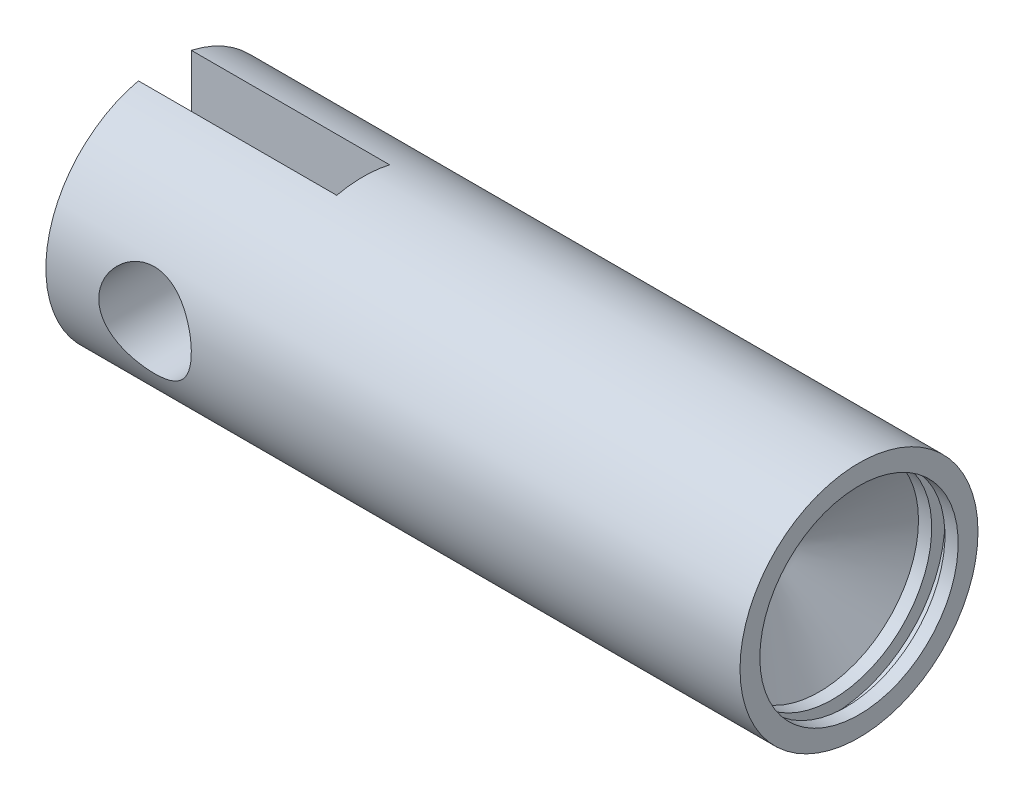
ISO-10303-21;
HEADER;
FILE_DESCRIPTION(('STEP AP214'),'2;1');
FILE_NAME('part.step','',(''),(''),'','','');
FILE_SCHEMA(('AUTOMOTIVE_DESIGN { 1 0 10303 214 1 1 1 1 }'));
ENDSEC;
DATA;
#1=APPLICATION_CONTEXT('core data for automotive mechanical design processes');
#2=APPLICATION_PROTOCOL_DEFINITION('international standard','automotive_design',2000,#1);
#3=PRODUCT_CONTEXT('',#1,'mechanical');
#4=PRODUCT('Part','Part','',(#3));
#5=PRODUCT_RELATED_PRODUCT_CATEGORY('part','',(#4));
#6=PRODUCT_DEFINITION_FORMATION('','',#4);
#7=PRODUCT_DEFINITION_CONTEXT('part definition',#1,'design');
#8=PRODUCT_DEFINITION('design','',#6,#7);
#9=PRODUCT_DEFINITION_SHAPE('','',#8);
#10=(LENGTH_UNIT() NAMED_UNIT(*) SI_UNIT(.MILLI.,.METRE.));
#11=(NAMED_UNIT(*) PLANE_ANGLE_UNIT() SI_UNIT($,.RADIAN.));
#12=(NAMED_UNIT(*) SI_UNIT($,.STERADIAN.) SOLID_ANGLE_UNIT());
#13=UNCERTAINTY_MEASURE_WITH_UNIT(LENGTH_MEASURE(1.E-05),#10,'distance_accuracy_value','');
#14=(GEOMETRIC_REPRESENTATION_CONTEXT(3) GLOBAL_UNCERTAINTY_ASSIGNED_CONTEXT((#13)) GLOBAL_UNIT_ASSIGNED_CONTEXT((#10,
#11,#12)) REPRESENTATION_CONTEXT('',''));
#15=CARTESIAN_POINT('',(0.,0.,0.));
#16=DIRECTION('',(0.,0.,1.));
#17=DIRECTION('',(1.,0.,0.));
#18=AXIS2_PLACEMENT_3D('',#15,#16,#17);
#19=CARTESIAN_POINT('',(30.,17.5499287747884,-3.99999999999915));
#20=DIRECTION('',(0.,0.,-1.));
#21=DIRECTION('',(0.,1.,0.));
#22=AXIS2_PLACEMENT_3D('',#19,#20,#21);
#23=PLANE('',#22);
#24=DIRECTION('',(0.,-1.,0.));
#25=VECTOR('',#24,1.);
#26=CARTESIAN_POINT('',(0.,17.5499287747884,-3.99999999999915));
#27=LINE('',#26,#25);
#28=CARTESIAN_POINT('',(0.,17.5499287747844,-3.99999999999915));
#29=VERTEX_POINT('',#28);
#30=CARTESIAN_POINT('',(0.,-17.5499287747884,-3.99999999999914));
#31=VERTEX_POINT('',#30);
#32=EDGE_CURVE('E113',#29,#31,#27,.T.);
#33=ORIENTED_EDGE('',*,*,#32,.T.);
#34=DIRECTION('',(-1.,0.,0.));
#35=VECTOR('',#34,1.);
#36=CARTESIAN_POINT('',(30.,-17.5499287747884,-3.99999999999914));
#37=LINE('',#36,#35);
#38=CARTESIAN_POINT('',(30.,-17.5499287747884,-3.99999999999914));
#39=VERTEX_POINT('',#38);
#40=EDGE_CURVE('E121',#39,#31,#37,.T.);
#41=ORIENTED_EDGE('',*,*,#40,.F.);
#42=DIRECTION('',(0.,-1.,0.));
#43=VECTOR('',#42,1.);
#44=CARTESIAN_POINT('',(30.,17.5499287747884,-3.99999999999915));
#45=LINE('',#44,#43);
#46=CARTESIAN_POINT('',(30.,17.5499287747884,-3.99999999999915));
#47=VERTEX_POINT('',#46);
#48=EDGE_CURVE('E128',#47,#39,#45,.T.);
#49=ORIENTED_EDGE('',*,*,#48,.F.);
#50=DIRECTION('',(-1.,0.,0.));
#51=VECTOR('',#50,1.);
#52=CARTESIAN_POINT('',(30.,17.5499287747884,-3.99999999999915));
#53=LINE('',#52,#51);
#54=EDGE_CURVE('E54',#47,#29,#53,.T.);
#55=ORIENTED_EDGE('',*,*,#54,.T.);
#56=EDGE_LOOP('',(#33,#41,#49,#55));
#57=FACE_BOUND('',#56,.T.);
#58=CARTESIAN_POINT('',(15.,0.,-3.99999999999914));
#59=DIRECTION('',(0.,0.,1.));
#60=DIRECTION('',(1.,0.,0.));
#61=AXIS2_PLACEMENT_3D('',#58,#59,#60);
#62=CIRCLE('',#61,6.99999999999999);
#63=CARTESIAN_POINT('',(22.,0.,-3.99999999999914));
#64=VERTEX_POINT('',#63);
#65=EDGE_CURVE('E187',#64,#64,#62,.T.);
#66=ORIENTED_EDGE('',*,*,#65,.F.);
#67=EDGE_LOOP('',(#66));
#68=FACE_BOUND('',#67,.T.);
#69=ADVANCED_FACE('F31',(#57,#68),#23,.F.);
#70=CARTESIAN_POINT('',(0.,-17.5499287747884,3.99999999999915));
#71=DIRECTION('',(0.,0.,1.));
#72=DIRECTION('',(0.,-1.,0.));
#73=AXIS2_PLACEMENT_3D('',#70,#71,#72);
#74=PLANE('',#73);
#75=DIRECTION('',(0.,-1.,0.));
#76=VECTOR('',#75,1.);
#77=CARTESIAN_POINT('',(30.,-17.5499287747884,3.99999999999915));
#78=LINE('',#77,#76);
#79=CARTESIAN_POINT('',(30.,17.5499287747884,3.99999999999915));
#80=VERTEX_POINT('',#79);
#81=CARTESIAN_POINT('',(30.,-17.5499287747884,3.99999999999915));
#82=VERTEX_POINT('',#81);
#83=EDGE_CURVE('E141',#80,#82,#78,.T.);
#84=ORIENTED_EDGE('',*,*,#83,.T.);
#85=DIRECTION('',(1.,0.,0.));
#86=VECTOR('',#85,1.);
#87=CARTESIAN_POINT('',(0.,-17.5499287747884,3.99999999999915));
#88=LINE('',#87,#86);
#89=CARTESIAN_POINT('',(0.,-17.5499287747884,3.99999999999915));
#90=VERTEX_POINT('',#89);
#91=EDGE_CURVE('E134',#90,#82,#88,.T.);
#92=ORIENTED_EDGE('',*,*,#91,.F.);
#93=DIRECTION('',(0.,-1.,0.));
#94=VECTOR('',#93,1.);
#95=CARTESIAN_POINT('',(0.,-17.5499287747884,3.99999999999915));
#96=LINE('',#95,#94);
#97=CARTESIAN_POINT('',(0.,17.5499287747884,3.99999999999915));
#98=VERTEX_POINT('',#97);
#99=EDGE_CURVE('E136',#98,#90,#96,.T.);
#100=ORIENTED_EDGE('',*,*,#99,.F.);
#101=DIRECTION('',(1.,0.,0.));
#102=VECTOR('',#101,1.);
#103=CARTESIAN_POINT('',(0.,17.5499287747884,3.99999999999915));
#104=LINE('',#103,#102);
#105=EDGE_CURVE('E46',#98,#80,#104,.T.);
#106=ORIENTED_EDGE('',*,*,#105,.T.);
#107=EDGE_LOOP('',(#84,#92,#100,#106));
#108=FACE_BOUND('',#107,.T.);
#109=CARTESIAN_POINT('',(15.,0.,3.99999999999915));
#110=DIRECTION('',(0.,0.,-1.));
#111=DIRECTION('',(0.,1.,0.));
#112=AXIS2_PLACEMENT_3D('',#109,#110,#111);
#113=CIRCLE('',#112,6.99999999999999);
#114=CARTESIAN_POINT('',(15.,6.99999999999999,3.99999999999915));
#115=VERTEX_POINT('',#114);
#116=EDGE_CURVE('E168',#115,#115,#113,.T.);
#117=ORIENTED_EDGE('',*,*,#116,.F.);
#118=EDGE_LOOP('',(#117));
#119=FACE_BOUND('',#118,.T.);
#120=ADVANCED_FACE('F92',(#108,#119),#74,.F.);
#121=CARTESIAN_POINT('',(30.,0.,0.));
#122=DIRECTION('',(-1.,0.,0.));
#123=DIRECTION('',(0.,0.,1.));
#124=AXIS2_PLACEMENT_3D('',#121,#122,#123);
#125=PLANE('',#124);
#126=CARTESIAN_POINT('',(30.,0.,0.));
#127=DIRECTION('',(-1.,0.,0.));
#128=DIRECTION('',(0.,0.,1.));
#129=AXIS2_PLACEMENT_3D('',#126,#127,#128);
#130=CIRCLE('',#129,18.0000000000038);
#131=EDGE_CURVE('E124',#39,#82,#130,.T.);
#132=ORIENTED_EDGE('',*,*,#131,.T.);
#133=ORIENTED_EDGE('',*,*,#83,.F.);
#134=EDGE_CURVE('E115',#80,#47,#130,.T.);
#135=ORIENTED_EDGE('',*,*,#134,.T.);
#136=ORIENTED_EDGE('',*,*,#48,.T.);
#137=EDGE_LOOP('',(#132,#133,#135,#136));
#138=FACE_BOUND('',#137,.T.);
#139=ADVANCED_FACE('F97',(#138),#125,.T.);
#140=CARTESIAN_POINT('',(0.,0.,0.));
#141=DIRECTION('',(1.,0.,0.));
#142=DIRECTION('',(0.,0.,-1.));
#143=AXIS2_PLACEMENT_3D('',#140,#141,#142);
#144=CYLINDRICAL_SURFACE('',#143,18.);
#145=CARTESIAN_POINT('',(8.00000000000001,0.,-18.));
#146=CARTESIAN_POINT('',(7.99999877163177,0.189022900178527,-18.0000009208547));
#147=CARTESIAN_POINT('',(8.00766202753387,0.378029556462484,-17.9970162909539));
#148=CARTESIAN_POINT('',(8.0382308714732,0.754619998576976,-17.9851613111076));
#149=CARTESIAN_POINT('',(8.06113593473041,0.9422038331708,-17.9762911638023));
#150=CARTESIAN_POINT('',(8.12194538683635,1.31451020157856,-17.9529064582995));
#151=CARTESIAN_POINT('',(8.15984587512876,1.49923346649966,-17.9383933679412));
#152=CARTESIAN_POINT('',(8.25027376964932,1.86456675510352,-17.9041072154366));
#153=CARTESIAN_POINT('',(8.30280166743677,2.04517664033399,-17.8843339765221));
#154=CARTESIAN_POINT('',(8.42186250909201,2.40065949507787,-17.8400910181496));
#155=CARTESIAN_POINT('',(8.48836353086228,2.57554450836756,-17.8156320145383));
#156=CARTESIAN_POINT('',(8.63490029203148,2.9189677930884,-17.7625963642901));
#157=CARTESIAN_POINT('',(8.71494074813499,3.0875038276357,-17.7340182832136));
#158=CARTESIAN_POINT('',(8.88790662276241,3.41715655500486,-17.6734582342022));
#159=CARTESIAN_POINT('',(8.98083049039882,3.5782741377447,-17.6414766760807));
#160=CARTESIAN_POINT('',(9.17894849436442,3.89227914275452,-17.5748665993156));
#161=CARTESIAN_POINT('',(9.28414706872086,4.04516355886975,-17.5402371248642));
#162=CARTESIAN_POINT('',(9.51061675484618,4.34785369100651,-17.4677233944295));
#163=CARTESIAN_POINT('',(9.63236649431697,4.49728345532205,-17.4297641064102));
#164=CARTESIAN_POINT('',(9.88762487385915,4.7854650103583,-17.3528548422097));
#165=CARTESIAN_POINT('',(10.021133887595,4.92421646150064,-17.3139048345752));
#166=CARTESIAN_POINT('',(10.2991940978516,5.19032503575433,-17.2360018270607));
#167=CARTESIAN_POINT('',(10.4437507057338,5.31767650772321,-17.1970488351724));
#168=CARTESIAN_POINT('',(10.7429852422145,5.56011631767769,-17.1202008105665));
#169=CARTESIAN_POINT('',(10.8976597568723,5.67520875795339,-17.0823054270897));
#170=CARTESIAN_POINT('',(11.2230349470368,5.8970258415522,-17.0070390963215));
#171=CARTESIAN_POINT('',(11.3941361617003,6.0031943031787,-16.9697573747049));
#172=CARTESIAN_POINT('',(11.745332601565,6.2006211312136,-16.8986185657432));
#173=CARTESIAN_POINT('',(11.9254244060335,6.29188511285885,-16.864760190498));
#174=CARTESIAN_POINT('',(12.2934662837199,6.45875311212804,-16.8015616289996));
#175=CARTESIAN_POINT('',(12.4814153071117,6.53435921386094,-16.772220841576));
#176=CARTESIAN_POINT('',(12.8638611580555,6.66918382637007,-16.7190683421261));
#177=CARTESIAN_POINT('',(13.0583575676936,6.72840338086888,-16.6952562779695));
#178=CARTESIAN_POINT('',(13.4438521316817,6.82761155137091,-16.6549231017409));
#179=CARTESIAN_POINT('',(13.634635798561,6.86832321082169,-16.6381304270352));
#180=CARTESIAN_POINT('',(14.0193787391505,6.9337183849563,-16.610984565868));
#181=CARTESIAN_POINT('',(14.2133377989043,6.95840297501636,-16.6006309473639));
#182=CARTESIAN_POINT('',(14.6028132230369,6.99145371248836,-16.586738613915));
#183=CARTESIAN_POINT('',(14.7983289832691,6.99982590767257,-16.5831973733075));
#184=CARTESIAN_POINT('',(15.1893731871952,7.0001686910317,-16.583052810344));
#185=CARTESIAN_POINT('',(15.3849016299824,6.99213998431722,-16.5864491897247));
#186=CARTESIAN_POINT('',(15.7616095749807,6.96084085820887,-16.5996070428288));
#187=CARTESIAN_POINT('',(15.9428910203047,6.93860183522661,-16.6089376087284));
#188=CARTESIAN_POINT('',(16.30285184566,6.8801042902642,-16.6332548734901));
#189=CARTESIAN_POINT('',(16.4815303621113,6.84384122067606,-16.6482434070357));
#190=CARTESIAN_POINT('',(16.8349854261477,6.75765586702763,-16.683412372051));
#191=CARTESIAN_POINT('',(17.0097629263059,6.7077369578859,-16.703591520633));
#192=CARTESIAN_POINT('',(17.3544388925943,6.59465916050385,-16.7485572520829));
#193=CARTESIAN_POINT('',(17.5243354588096,6.531495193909,-16.7733456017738));
#194=CARTESIAN_POINT('',(17.8614342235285,6.39110118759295,-16.82734642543));
#195=CARTESIAN_POINT('',(18.0285204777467,6.31362237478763,-16.8566352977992));
#196=CARTESIAN_POINT('',(18.3556537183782,6.14600522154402,-16.9184691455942));
#197=CARTESIAN_POINT('',(18.5156982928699,6.05586258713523,-16.9510152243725));
#198=CARTESIAN_POINT('',(18.8278716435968,5.86353255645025,-17.0185008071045));
#199=CARTESIAN_POINT('',(18.9799994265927,5.76134365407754,-17.0534406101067));
#200=CARTESIAN_POINT('',(19.2755564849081,5.54554789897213,-17.1248303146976));
#201=CARTESIAN_POINT('',(19.4189853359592,5.43194049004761,-17.1612802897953));
#202=CARTESIAN_POINT('',(19.7065515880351,5.18525090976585,-17.237488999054));
#203=CARTESIAN_POINT('',(19.8499773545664,5.05135263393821,-17.2772951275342));
#204=CARTESIAN_POINT('',(20.1250946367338,4.77198380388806,-17.3565331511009));
#205=CARTESIAN_POINT('',(20.2567896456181,4.62651671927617,-17.3959651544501));
#206=CARTESIAN_POINT('',(20.5077440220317,4.32472983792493,-17.4734366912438));
#207=CARTESIAN_POINT('',(20.626996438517,4.16840405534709,-17.5114754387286));
#208=CARTESIAN_POINT('',(20.8521226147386,3.84594718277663,-17.5851080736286));
#209=CARTESIAN_POINT('',(20.9580017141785,3.67982004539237,-17.6207029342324));
#210=CARTESIAN_POINT('',(21.1574465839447,3.33558623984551,-17.6891269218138));
#211=CARTESIAN_POINT('',(21.2507523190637,3.15731625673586,-17.7218937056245));
#212=CARTESIAN_POINT('',(21.4218805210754,2.79284146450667,-17.782973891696));
#213=CARTESIAN_POINT('',(21.4997091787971,2.60663986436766,-17.811289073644));
#214=CARTESIAN_POINT('',(21.6391715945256,2.22759348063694,-17.8626536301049));
#215=CARTESIAN_POINT('',(21.7008082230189,2.03474988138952,-17.8857039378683));
#216=CARTESIAN_POINT('',(21.8072544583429,1.64386977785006,-17.9258550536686));
#217=CARTESIAN_POINT('',(21.8520651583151,1.44583361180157,-17.9429562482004));
#218=CARTESIAN_POINT('',(21.9223149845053,1.05748077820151,-17.9699041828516));
#219=CARTESIAN_POINT('',(21.9487059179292,0.867360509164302,-17.9801063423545));
#220=CARTESIAN_POINT('',(21.9857878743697,0.485371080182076,-17.9944696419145));
#221=CARTESIAN_POINT('',(21.9964796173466,0.293502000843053,-17.9986310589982));
#222=CARTESIAN_POINT('',(22.0020479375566,-0.090459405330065,-18.0007963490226));
#223=CARTESIAN_POINT('',(21.9969277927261,-0.282551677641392,-17.9988014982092));
#224=CARTESIAN_POINT('',(21.9709350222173,-0.665503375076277,-17.9887128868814));
#225=CARTESIAN_POINT('',(21.9500626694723,-0.856362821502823,-17.980619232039));
#226=CARTESIAN_POINT('',(21.8940003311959,-1.22738012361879,-17.9590257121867));
#227=CARTESIAN_POINT('',(21.859451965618,-1.40764961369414,-17.9457684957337));
#228=CARTESIAN_POINT('',(21.7764231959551,-1.76455917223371,-17.9141965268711));
#229=CARTESIAN_POINT('',(21.727938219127,-1.94119802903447,-17.8958801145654));
#230=CARTESIAN_POINT('',(21.6174868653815,-2.28959732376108,-17.8546495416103));
#231=CARTESIAN_POINT('',(21.5555241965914,-2.4613590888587,-17.8317366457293));
#232=CARTESIAN_POINT('',(21.4185958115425,-2.79907910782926,-17.7818533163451));
#233=CARTESIAN_POINT('',(21.3436251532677,-2.96503512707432,-17.7548813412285));
#234=CARTESIAN_POINT('',(21.1788475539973,-3.29497337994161,-17.696667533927));
#235=CARTESIAN_POINT('',(21.0886656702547,-3.4587501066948,-17.6653225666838));
#236=CARTESIAN_POINT('',(20.8957586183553,-3.77820881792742,-17.5997653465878));
#237=CARTESIAN_POINT('',(20.7930291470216,-3.9338879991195,-17.5655521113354));
#238=CARTESIAN_POINT('',(20.5757131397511,-4.23628328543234,-17.4950853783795));
#239=CARTESIAN_POINT('',(20.4611247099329,-4.38299795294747,-17.4588315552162));
#240=CARTESIAN_POINT('',(20.2207940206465,-4.66667675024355,-17.3851548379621));
#241=CARTESIAN_POINT('',(20.095051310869,-4.80364048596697,-17.3477318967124));
#242=CARTESIAN_POINT('',(19.8248986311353,-5.07536393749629,-17.2702597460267));
#243=CARTESIAN_POINT('',(19.6798126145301,-5.20944741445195,-17.2301929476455));
#244=CARTESIAN_POINT('',(19.3787518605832,-5.46493358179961,-17.1508714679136));
#245=CARTESIAN_POINT('',(19.2227805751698,-5.58634026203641,-17.1116165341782));
#246=CARTESIAN_POINT('',(18.9007254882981,-5.81579327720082,-17.0349989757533));
#247=CARTESIAN_POINT('',(18.7346362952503,-5.92383239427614,-16.9976373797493));
#248=CARTESIAN_POINT('',(18.3934750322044,-6.12565012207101,-16.9259528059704));
#249=CARTESIAN_POINT('',(18.2184067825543,-6.21943473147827,-16.8916285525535));
#250=CARTESIAN_POINT('',(17.8589525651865,-6.39269060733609,-16.8268277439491));
#251=CARTESIAN_POINT('',(17.6745061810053,-6.47204835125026,-16.7963822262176));
#252=CARTESIAN_POINT('',(17.2988589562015,-6.61480150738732,-16.7406772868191));
#253=CARTESIAN_POINT('',(17.1076610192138,-6.67820368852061,-16.7154156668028));
#254=CARTESIAN_POINT('',(16.7199157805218,-6.78840894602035,-16.6709639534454));
#255=CARTESIAN_POINT('',(16.5233703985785,-6.83521789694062,-16.6517717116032));
#256=CARTESIAN_POINT('',(16.1264440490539,-6.91172661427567,-16.6201611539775));
#257=CARTESIAN_POINT('',(15.9260633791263,-6.94142770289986,-16.6077423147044));
#258=CARTESIAN_POINT('',(15.536996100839,-6.9819213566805,-16.5907569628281));
#259=CARTESIAN_POINT('',(15.3484500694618,-6.99387109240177,-16.5857102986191));
#260=CARTESIAN_POINT('',(14.9709492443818,-7.00248500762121,-16.5820755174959));
#261=CARTESIAN_POINT('',(14.7819944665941,-6.99914977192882,-16.5834871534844));
#262=CARTESIAN_POINT('',(14.4051531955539,-6.97723284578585,-16.592720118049));
#263=CARTESIAN_POINT('',(14.21726658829,-6.9586528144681,-16.6005407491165));
#264=CARTESIAN_POINT('',(13.8439590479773,-6.90645280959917,-16.6223255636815));
#265=CARTESIAN_POINT('',(13.6585381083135,-6.87283287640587,-16.6362897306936));
#266=CARTESIAN_POINT('',(13.2980402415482,-6.79236485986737,-16.6693009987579));
#267=CARTESIAN_POINT('',(13.1228300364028,-6.74603016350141,-16.688149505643));
#268=CARTESIAN_POINT('',(12.7769967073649,-6.64010367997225,-16.7305790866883));
#269=CARTESIAN_POINT('',(12.6063751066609,-6.58050755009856,-16.7541617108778));
#270=CARTESIAN_POINT('',(12.2707956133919,-6.44856072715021,-16.8053880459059));
#271=CARTESIAN_POINT('',(12.1058368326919,-6.37621204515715,-16.8330311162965));
#272=CARTESIAN_POINT('',(11.7824247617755,-6.21928928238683,-16.891638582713));
#273=CARTESIAN_POINT('',(11.6239740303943,-6.13471045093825,-16.922604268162));
#274=CARTESIAN_POINT('',(11.1427026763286,-5.85354969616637,-17.022836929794));
#275=CARTESIAN_POINT('',(10.832339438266,-5.63672493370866,-17.0965173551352));
#276=CARTESIAN_POINT('',(10.2509761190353,-5.15645525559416,-17.2474378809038));
#277=CARTESIAN_POINT('',(9.9799890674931,-4.89299497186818,-17.3246791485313));
#278=CARTESIAN_POINT('',(9.60017410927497,-4.45891382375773,-17.4396791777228));
#279=CARTESIAN_POINT('',(9.47494185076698,-4.30277213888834,-17.4789502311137));
#280=CARTESIAN_POINT('',(9.23809110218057,-3.9800036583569,-17.5552562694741));
#281=CARTESIAN_POINT('',(9.12646760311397,-3.81338075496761,-17.5922920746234));
#282=CARTESIAN_POINT('',(8.91759749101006,-3.47054816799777,-17.6631242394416));
#283=CARTESIAN_POINT('',(8.82036043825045,-3.29433221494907,-17.6969184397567));
#284=CARTESIAN_POINT('',(8.64120231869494,-2.93363627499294,-17.7602727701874));
#285=CARTESIAN_POINT('',(8.55927490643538,-2.74915975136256,-17.7898346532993));
#286=CARTESIAN_POINT('',(8.40585634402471,-2.35891513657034,-17.8459307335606));
#287=CARTESIAN_POINT('',(8.33562444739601,-2.15259234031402,-17.8720664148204));
#288=CARTESIAN_POINT('',(8.21455528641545,-1.73357991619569,-17.917564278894));
#289=CARTESIAN_POINT('',(8.16371962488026,-1.52088976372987,-17.9369259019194));
#290=CARTESIAN_POINT('',(8.08212905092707,-1.0912590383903,-17.9681806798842));
#291=CARTESIAN_POINT('',(8.05136391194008,-0.87432068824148,-17.9800776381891));
#292=CARTESIAN_POINT('',(8.01030171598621,-0.438247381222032,-17.9959861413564));
#293=CARTESIAN_POINT('',(8.00000142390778,-0.219112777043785,-17.9999989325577));
#294=CARTESIAN_POINT('',(8.00000000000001,0.,-18.));
#295=B_SPLINE_CURVE_WITH_KNOTS('',3,(#145,#146,#147,#148,#149,#150,#151,#152,#153,#154,#155,
#156,#157,#158,#159,#160,#161,#162,#163,#164,#165,#166,#167,#168,#169,#170,#171,#172,#173,#174,
#175,#176,#177,#178,#179,#180,#181,#182,#183,#184,#185,#186,#187,#188,#189,#190,#191,#192,#193,
#194,#195,#196,#197,#198,#199,#200,#201,#202,#203,#204,#205,#206,#207,#208,#209,#210,#211,#212,
#213,#214,#215,#216,#217,#218,#219,#220,#221,#222,#223,#224,#225,#226,#227,#228,#229,#230,#231,
#232,#233,#234,#235,#236,#237,#238,#239,#240,#241,#242,#243,#244,#245,#246,#247,#248,#249,#250,
#251,#252,#253,#254,#255,#256,#257,#258,#259,#260,#261,#262,#263,#264,#265,#266,#267,#268,#269,
#270,#271,#272,#273,#274,#275,#276,#277,#278,#279,#280,#281,#282,#283,#284,#285,#286,#287,#288,
#289,#290,#291,#292,#293,#294),.UNSPECIFIED.,.T.,.F.,(4,2,2,2,2,2,2,2,2,2,2,2,2,2,2,2,2,2,2,2,2,
2,2,2,2,2,2,2,2,2,2,2,2,2,2,2,2,2,2,2,2,2,2,2,2,2,2,2,2,2,2,2,2,2,2,2,2,2,2,2,2,2,2,2,2,2,2,2,2,
2,2,2,2,2,4),(0.,0.566862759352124,1.13370600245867,1.70040189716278,2.26711683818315,
2.83255090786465,3.39818236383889,3.96374578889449,4.52951433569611,5.11821464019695,
5.70693365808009,6.29594291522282,6.88475444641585,7.49835189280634,8.11171763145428,
8.72500167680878,9.33824665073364,9.92487834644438,10.5114706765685,11.0978454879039,
11.6841950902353,12.232188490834,12.780359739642,13.328395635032,13.8766420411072,
14.4355085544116,14.9945650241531,15.5536914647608,16.1128451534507,16.7127901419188,
17.312555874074,17.9126548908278,18.5125135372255,19.1233215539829,19.7338847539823,
20.3443396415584,20.9547548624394,21.5306662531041,22.1065512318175,22.6823168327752,
23.2580724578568,23.8095224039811,24.3611534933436,24.9126330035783,25.4643224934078,
26.032420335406,26.60071355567,27.1690976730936,27.7375047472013,28.3415392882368,
28.9453831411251,29.5495516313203,30.1534651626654,30.7619424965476,31.370161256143,
31.9781644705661,32.5861206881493,33.1523785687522,33.7186147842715,34.2847893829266,
34.8509624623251,35.3969849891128,35.9431865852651,36.4893021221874,37.0356303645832,
38.1874510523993,39.3396520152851,39.9509492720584,40.5620208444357,41.1734966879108,
41.7847185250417,42.4422030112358,43.099741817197,43.7569453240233,44.4140449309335),.UNSPECIFIED.);
#296=CARTESIAN_POINT('',(8.00000000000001,0.,-18.));
#297=VERTEX_POINT('',#296);
#298=EDGE_CURVE('E182',#297,#297,#295,.T.);
#299=ORIENTED_EDGE('',*,*,#298,.F.);
#300=EDGE_LOOP('',(#299));
#301=FACE_BOUND('',#300,.T.);
#302=CARTESIAN_POINT('',(15.,6.99999999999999,16.583123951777));
#303=CARTESIAN_POINT('',(14.8115900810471,7.00000128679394,16.5831227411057));
#304=CARTESIAN_POINT('',(14.623196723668,6.99238720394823,16.5863434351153));
#305=CARTESIAN_POINT('',(14.2478504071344,6.96201946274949,16.5991132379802));
#306=CARTESIAN_POINT('',(14.0608974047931,6.93926626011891,16.6086621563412));
#307=CARTESIAN_POINT('',(13.6898560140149,6.87887000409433,16.6337672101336));
#308=CARTESIAN_POINT('',(13.5057672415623,6.8412289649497,16.6493225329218));
#309=CARTESIAN_POINT('',(13.1417210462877,6.75144057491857,16.6859340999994));
#310=CARTESIAN_POINT('',(12.9617637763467,6.6992926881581,16.7069905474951));
#311=CARTESIAN_POINT('',(12.6076755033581,6.58114902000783,16.7538801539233));
#312=CARTESIAN_POINT('',(12.4335295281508,6.51519262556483,16.7796997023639));
#313=CARTESIAN_POINT('',(12.09153050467,6.36987750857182,16.8354005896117));
#314=CARTESIAN_POINT('',(11.9236796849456,6.29051409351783,16.8652833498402));
#315=CARTESIAN_POINT('',(11.5952943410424,6.11901056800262,16.9282618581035));
#316=CARTESIAN_POINT('',(11.4347591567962,6.02687161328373,16.9613573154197));
#317=CARTESIAN_POINT('',(11.1217827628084,5.83040175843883,17.0298925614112));
#318=CARTESIAN_POINT('',(10.9693445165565,5.72606643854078,17.0653331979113));
#319=CARTESIAN_POINT('',(10.6662107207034,5.50051558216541,17.1394016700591));
#320=CARTESIAN_POINT('',(10.5159590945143,5.37872643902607,17.1781007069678));
#321=CARTESIAN_POINT('',(10.2261146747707,5.12321632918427,17.2560276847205));
#322=CARTESIAN_POINT('',(10.0865221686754,4.98949504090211,17.2952556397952));
#323=CARTESIAN_POINT('',(9.81874725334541,4.71083560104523,17.3732255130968));
#324=CARTESIAN_POINT('',(9.69056948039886,4.56589293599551,17.4119672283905));
#325=CARTESIAN_POINT('',(9.44651880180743,4.26570652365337,17.4879303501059));
#326=CARTESIAN_POINT('',(9.33064164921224,4.11046636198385,17.5251522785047));
#327=CARTESIAN_POINT('',(9.10781262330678,3.78451386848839,17.5984768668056));
#328=CARTESIAN_POINT('',(9.00135807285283,3.61343970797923,17.6344852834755));
#329=CARTESIAN_POINT('',(8.80336009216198,3.26224941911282,17.702816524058));
#330=CARTESIAN_POINT('',(8.71181102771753,3.08213674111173,17.7351407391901));
#331=CARTESIAN_POINT('',(8.54439224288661,2.71403828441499,17.7951893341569));
#332=CARTESIAN_POINT('',(8.46852118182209,2.52605318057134,17.8229141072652));
#333=CARTESIAN_POINT('',(8.33319630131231,2.14356549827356,17.872949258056));
#334=CARTESIAN_POINT('',(8.27374149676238,1.94906331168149,17.8952599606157));
#335=CARTESIAN_POINT('',(8.17422589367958,1.56412606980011,17.9329074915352));
#336=CARTESIAN_POINT('',(8.13339842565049,1.37391584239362,17.9485180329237));
#337=CARTESIAN_POINT('',(8.06768363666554,0.990373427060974,17.973761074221));
#338=CARTESIAN_POINT('',(8.04279542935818,0.797041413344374,17.9833939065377));
#339=CARTESIAN_POINT('',(8.00923348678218,0.408820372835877,17.9964045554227));
#340=CARTESIAN_POINT('',(8.00055513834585,0.213931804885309,17.9997841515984));
#341=CARTESIAN_POINT('',(7.99949653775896,-0.1758932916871,18.0001957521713));
#342=CARTESIAN_POINT('',(8.00711574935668,-0.370829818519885,17.9972279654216));
#343=CARTESIAN_POINT('',(8.03772344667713,-0.748810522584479,17.9853582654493));
#344=CARTESIAN_POINT('',(8.05986951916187,-0.931933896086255,17.9767816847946));
#345=CARTESIAN_POINT('',(8.11847734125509,-1.29559937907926,17.954236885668));
#346=CARTESIAN_POINT('',(8.15494377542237,-1.4761406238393,17.9402669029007));
#347=CARTESIAN_POINT('',(8.24183447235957,-1.83329406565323,17.9072942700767));
#348=CARTESIAN_POINT('',(8.29225417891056,-2.00990752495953,17.8882932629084));
#349=CARTESIAN_POINT('',(8.40663075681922,-2.35819710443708,17.8457194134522));
#350=CARTESIAN_POINT('',(8.47059276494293,-2.52987132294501,17.8221448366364));
#351=CARTESIAN_POINT('',(8.61253797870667,-2.86961899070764,17.7706284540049));
#352=CARTESIAN_POINT('',(8.69071078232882,-3.03760431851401,17.7426283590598));
#353=CARTESIAN_POINT('',(8.8598584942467,-3.36643149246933,17.6831860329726));
#354=CARTESIAN_POINT('',(8.95083776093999,-3.52727088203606,17.6517426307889));
#355=CARTESIAN_POINT('',(9.14494766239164,-3.84088189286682,17.5861677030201));
#356=CARTESIAN_POINT('',(9.24807945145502,-3.99365274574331,17.552035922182));
#357=CARTESIAN_POINT('',(9.46583142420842,-4.29031926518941,17.4818877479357));
#358=CARTESIAN_POINT('',(9.58045218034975,-4.43421448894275,17.4458712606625));
#359=CARTESIAN_POINT('',(9.82804028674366,-4.72111731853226,17.3705039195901));
#360=CARTESIAN_POINT('',(9.96170724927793,-4.86350410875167,17.3310855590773));
#361=CARTESIAN_POINT('',(10.2403988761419,-5.13655967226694,17.2521289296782));
#362=CARTESIAN_POINT('',(10.3854201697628,-5.26723189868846,17.2125906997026));
#363=CARTESIAN_POINT('',(10.6861180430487,-5.51620772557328,17.1344241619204));
#364=CARTESIAN_POINT('',(10.8418015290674,-5.63450318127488,17.095796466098));
#365=CARTESIAN_POINT('',(11.1627894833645,-5.85781752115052,17.0205715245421));
#366=CARTESIAN_POINT('',(11.3280901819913,-5.96284155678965,16.9839734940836));
#367=CARTESIAN_POINT('',(11.6718194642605,-6.16146298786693,16.9129474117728));
#368=CARTESIAN_POINT('',(11.8504773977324,-6.2546931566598,16.8786003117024));
#369=CARTESIAN_POINT('',(12.2157498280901,-6.42561995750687,16.8142722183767));
#370=CARTESIAN_POINT('',(12.402361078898,-6.50332285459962,16.7842894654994));
#371=CARTESIAN_POINT('',(12.7822589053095,-6.64247933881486,16.7297058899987));
#372=CARTESIAN_POINT('',(12.9755435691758,-6.7039375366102,16.7051035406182));
#373=CARTESIAN_POINT('',(13.3673682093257,-6.80997032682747,16.6621602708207));
#374=CARTESIAN_POINT('',(13.5659077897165,-6.85454618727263,16.6438188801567));
#375=CARTESIAN_POINT('',(13.9548943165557,-6.92419537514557,16.6149587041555));
#376=CARTESIAN_POINT('',(14.1451354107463,-6.95025688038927,16.6040451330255));
#377=CARTESIAN_POINT('',(14.5273733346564,-6.98666411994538,16.5887588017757));
#378=CARTESIAN_POINT('',(14.7193700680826,-6.99701071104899,16.5843856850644));
#379=CARTESIAN_POINT('',(15.1035530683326,-7.0018693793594,16.5823349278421));
#380=CARTESIAN_POINT('',(15.2957392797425,-6.99638519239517,16.5846557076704));
#381=CARTESIAN_POINT('',(15.6788133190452,-6.96965387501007,16.5959071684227));
#382=CARTESIAN_POINT('',(15.8697011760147,-6.94840709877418,16.6048377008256));
#383=CARTESIAN_POINT('',(16.2386665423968,-6.89192842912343,16.6283552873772));
#384=CARTESIAN_POINT('',(16.416887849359,-6.85749511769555,16.6426183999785));
#385=CARTESIAN_POINT('',(16.7697087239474,-6.77502490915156,16.6763611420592));
#386=CARTESIAN_POINT('',(16.9443070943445,-6.72698358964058,16.695842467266));
#387=CARTESIAN_POINT('',(17.2886955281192,-6.61774154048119,16.7394429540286));
#388=CARTESIAN_POINT('',(17.4584865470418,-6.55654344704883,16.7635611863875));
#389=CARTESIAN_POINT('',(17.7923781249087,-6.4214540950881,16.8157714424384));
#390=CARTESIAN_POINT('',(17.956476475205,-6.34755797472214,16.8438649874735));
#391=CARTESIAN_POINT('',(18.2842878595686,-6.18451724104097,16.9044253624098));
#392=CARTESIAN_POINT('',(18.4477380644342,-6.09489162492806,16.9370197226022));
#393=CARTESIAN_POINT('',(18.7666384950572,-5.90314033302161,17.0048015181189));
#394=CARTESIAN_POINT('',(18.922085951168,-5.80101037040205,17.0399898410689));
#395=CARTESIAN_POINT('',(19.224140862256,-5.58490148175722,17.1120380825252));
#396=CARTESIAN_POINT('',(19.3707468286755,-5.47092056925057,17.1488982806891));
#397=CARTESIAN_POINT('',(19.6543400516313,-5.23178034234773,17.2233607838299));
#398=CARTESIAN_POINT('',(19.7913269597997,-5.1066206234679,17.2609631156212));
#399=CARTESIAN_POINT('',(20.0641111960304,-4.83674418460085,17.3385973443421));
#400=CARTESIAN_POINT('',(20.1991669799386,-4.69127310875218,17.3786168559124));
#401=CARTESIAN_POINT('',(20.4565543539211,-4.3892336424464,17.4573472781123));
#402=CARTESIAN_POINT('',(20.5788900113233,-4.23266882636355,17.4960586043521));
#403=CARTESIAN_POINT('',(20.8101004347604,-3.90925334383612,17.5711497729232));
#404=CARTESIAN_POINT('',(20.9189692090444,-3.74239814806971,17.6075285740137));
#405=CARTESIAN_POINT('',(21.122310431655,-3.39956129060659,17.6769214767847));
#406=CARTESIAN_POINT('',(21.2167890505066,-3.22358358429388,17.7099370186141));
#407=CARTESIAN_POINT('',(21.3904939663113,-2.86381446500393,17.7716579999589));
#408=CARTESIAN_POINT('',(21.469740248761,-2.68003368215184,17.8003690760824));
#409=CARTESIAN_POINT('',(21.6123667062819,-2.30579399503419,17.8527026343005));
#410=CARTESIAN_POINT('',(21.6757534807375,-2.11533790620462,17.8763272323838));
#411=CARTESIAN_POINT('',(21.7860452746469,-1.72913530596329,17.9178067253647));
#412=CARTESIAN_POINT('',(21.8329537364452,-1.53338990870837,17.9356628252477));
#413=CARTESIAN_POINT('',(21.9097889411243,-1.13813095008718,17.9650749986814));
#414=CARTESIAN_POINT('',(21.939716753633,-0.938617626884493,17.9766314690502));
#415=CARTESIAN_POINT('',(21.9809253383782,-0.549965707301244,17.9925813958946));
#416=CARTESIAN_POINT('',(21.993250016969,-0.360953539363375,17.9973756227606));
#417=CARTESIAN_POINT('',(22.0025365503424,0.017502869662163,18.0009860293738));
#418=CARTESIAN_POINT('',(21.9994989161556,0.206947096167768,17.9998024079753));
#419=CARTESIAN_POINT('',(21.9780947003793,0.584808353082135,17.991489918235));
#420=CARTESIAN_POINT('',(21.9597301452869,0.773225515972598,17.984361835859));
#421=CARTESIAN_POINT('',(21.9078660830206,1.14765314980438,17.9643547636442));
#422=CARTESIAN_POINT('',(21.8743666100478,1.33366362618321,17.951475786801));
#423=CARTESIAN_POINT('',(21.7937174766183,1.69676624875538,17.9207491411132));
#424=CARTESIAN_POINT('',(21.7469769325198,1.87396221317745,17.9030509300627));
#425=CARTESIAN_POINT('',(21.6399198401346,2.22371942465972,17.8629805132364));
#426=CARTESIAN_POINT('',(21.5795988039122,2.3962791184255,17.8406067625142));
#427=CARTESIAN_POINT('',(21.4459000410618,2.7356191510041,17.7917327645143));
#428=CARTESIAN_POINT('',(21.3725252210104,2.9024007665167,17.7652334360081));
#429=CARTESIAN_POINT('',(21.2132721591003,3.22929592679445,17.7087330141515));
#430=CARTESIAN_POINT('',(21.1273890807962,3.38940686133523,17.6787305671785));
#431=CARTESIAN_POINT('',(20.8439688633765,3.87179997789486,17.58179246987));
#432=CARTESIAN_POINT('',(20.6263634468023,4.18161914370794,17.5100936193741));
#433=CARTESIAN_POINT('',(20.1448818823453,4.76154998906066,17.3613807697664));
#434=CARTESIAN_POINT('',(19.8809887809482,5.03164705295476,17.2843648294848));
#435=CARTESIAN_POINT('',(19.4469410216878,5.40966452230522,17.1684103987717));
#436=CARTESIAN_POINT('',(19.2911116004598,5.53409098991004,17.1286079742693));
#437=CARTESIAN_POINT('',(18.969135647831,5.76937376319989,17.0507964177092));
#438=CARTESIAN_POINT('',(18.8029928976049,5.88023499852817,17.0127866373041));
#439=CARTESIAN_POINT('',(18.4612475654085,6.08767252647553,16.9396682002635));
#440=CARTESIAN_POINT('',(18.2856383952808,6.1842386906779,16.9045616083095));
#441=CARTESIAN_POINT('',(17.9262386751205,6.36217845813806,16.8383993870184));
#442=CARTESIAN_POINT('',(17.7424515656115,6.4435583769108,16.8073420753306));
#443=CARTESIAN_POINT('',(17.3534434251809,6.59607704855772,16.7481037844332));
#444=CARTESIAN_POINT('',(17.1476608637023,6.66594736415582,16.7203275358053));
#445=CARTESIAN_POINT('',(16.7296967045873,6.78641667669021,16.6717958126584));
#446=CARTESIAN_POINT('',(16.5175146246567,6.83701421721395,16.6510408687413));
#447=CARTESIAN_POINT('',(16.0888866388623,6.91822741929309,16.6174626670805));
#448=CARTESIAN_POINT('',(15.872443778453,6.94885685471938,16.6046339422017));
#449=CARTESIAN_POINT('',(15.4373262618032,6.9897407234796,16.5874659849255));
#450=CARTESIAN_POINT('',(15.2186519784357,6.99999850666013,16.5831253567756));
#451=CARTESIAN_POINT('',(15.,6.99999999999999,16.583123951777));
#452=B_SPLINE_CURVE_WITH_KNOTS('',3,(#302,#303,#304,#305,#306,#307,#308,#309,#310,#311,#312,
#313,#314,#315,#316,#317,#318,#319,#320,#321,#322,#323,#324,#325,#326,#327,#328,#329,#330,#331,
#332,#333,#334,#335,#336,#337,#338,#339,#340,#341,#342,#343,#344,#345,#346,#347,#348,#349,#350,
#351,#352,#353,#354,#355,#356,#357,#358,#359,#360,#361,#362,#363,#364,#365,#366,#367,#368,#369,
#370,#371,#372,#373,#374,#375,#376,#377,#378,#379,#380,#381,#382,#383,#384,#385,#386,#387,#388,
#389,#390,#391,#392,#393,#394,#395,#396,#397,#398,#399,#400,#401,#402,#403,#404,#405,#406,#407,
#408,#409,#410,#411,#412,#413,#414,#415,#416,#417,#418,#419,#420,#421,#422,#423,#424,#425,#426,
#427,#428,#429,#430,#431,#432,#433,#434,#435,#436,#437,#438,#439,#440,#441,#442,#443,#444,#445,
#446,#447,#448,#449,#450,#451),.UNSPECIFIED.,.T.,.F.,(4,2,2,2,2,2,2,2,2,2,2,2,2,2,2,2,2,2,2,2,2,
2,2,2,2,2,2,2,2,2,2,2,2,2,2,2,2,2,2,2,2,2,2,2,2,2,2,2,2,2,2,2,2,2,2,2,2,2,2,2,2,2,2,2,2,2,2,2,2,
2,2,2,2,2,4),(0.,0.565021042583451,1.13002507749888,1.69495269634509,2.25990118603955,
2.82325966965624,3.38681574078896,3.95032086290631,4.51403082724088,5.10510900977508,
5.69620312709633,6.28753624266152,6.8786645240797,7.49194912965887,8.10500137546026,
8.71800117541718,9.33096418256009,9.91571541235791,10.5004341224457,11.0849864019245,
11.669519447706,12.2228396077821,12.7763409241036,13.3296617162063,13.8831927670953,
14.4447381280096,15.0064750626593,15.5682653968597,16.1300837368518,16.7271122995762,
17.3239642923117,17.9212066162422,18.5182163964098,19.1307179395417,19.7429718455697,
20.3550517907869,20.9670857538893,21.543323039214,22.1195289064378,22.6955988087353,
23.271655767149,23.8172637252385,24.3630492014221,24.9087254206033,25.4546110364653,
26.0217118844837,26.5890076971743,27.1563987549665,27.7238103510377,28.3305780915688,
28.9371512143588,29.5439932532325,30.1505743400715,30.7563540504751,31.3618812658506,
31.9672819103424,32.5726444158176,33.1403596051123,33.7080559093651,34.2756771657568,
34.8432971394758,35.3950000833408,35.9468856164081,36.4986484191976,37.0506251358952,
38.2012946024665,39.3523864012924,39.9618069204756,40.5710053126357,41.1806332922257,
41.7900071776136,42.4462323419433,43.1025070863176,43.7583286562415,44.4140423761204),.UNSPECIFIED.);
#453=CARTESIAN_POINT('',(15.,6.99999999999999,16.583123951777));
#454=VERTEX_POINT('',#453);
#455=EDGE_CURVE('E161',#454,#454,#452,.T.);
#456=ORIENTED_EDGE('',*,*,#455,.F.);
#457=EDGE_LOOP('',(#456));
#458=FACE_BOUND('',#457,.T.);
#459=ORIENTED_EDGE('',*,*,#54,.F.);
#460=ORIENTED_EDGE('',*,*,#134,.F.);
#461=ORIENTED_EDGE('',*,*,#105,.F.);
#462=CARTESIAN_POINT('',(0.,0.,0.));
#463=DIRECTION('',(-1.,0.,0.));
#464=DIRECTION('',(0.,0.,-1.));
#465=AXIS2_PLACEMENT_3D('',#462,#463,#464);
#466=CIRCLE('',#465,18.0000000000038);
#467=EDGE_CURVE('E138',#90,#98,#466,.T.);
#468=ORIENTED_EDGE('',*,*,#467,.F.);
#469=ORIENTED_EDGE('',*,*,#91,.T.);
#470=ORIENTED_EDGE('',*,*,#131,.F.);
#471=ORIENTED_EDGE('',*,*,#40,.T.);
#472=CARTESIAN_POINT('',(0.,0.,0.));
#473=DIRECTION('',(1.,0.,0.));
#474=DIRECTION('',(0.,0.,-1.));
#475=AXIS2_PLACEMENT_3D('',#472,#473,#474);
#476=CIRCLE('',#475,18.);
#477=EDGE_CURVE('E11',#31,#29,#476,.T.);
#478=ORIENTED_EDGE('',*,*,#477,.T.);
#479=EDGE_LOOP('',(#459,#460,#461,#468,#469,#470,#471,#478));
#480=FACE_BOUND('',#479,.T.);
#481=CARTESIAN_POINT('',(105.,0.,0.));
#482=DIRECTION('',(1.,0.,0.));
#483=DIRECTION('',(0.,0.,-1.));
#484=AXIS2_PLACEMENT_3D('',#481,#482,#483);
#485=CIRCLE('',#484,18.);
#486=CARTESIAN_POINT('',(105.,0.,-18.));
#487=VERTEX_POINT('',#486);
#488=EDGE_CURVE('E39',#487,#487,#485,.T.);
#489=ORIENTED_EDGE('',*,*,#488,.F.);
#490=EDGE_LOOP('',(#489));
#491=FACE_BOUND('',#490,.T.);
#492=ADVANCED_FACE('F33',(#301,#458,#480,#491),#144,.T.);
#493=CARTESIAN_POINT('',(0.,18.,0.));
#494=DIRECTION('',(-1.,0.,0.));
#495=DIRECTION('',(0.,0.,1.));
#496=AXIS2_PLACEMENT_3D('',#493,#494,#495);
#497=PLANE('',#496);
#498=ORIENTED_EDGE('',*,*,#32,.F.);
#499=ORIENTED_EDGE('',*,*,#477,.F.);
#500=EDGE_LOOP('',(#498,#499));
#501=FACE_BOUND('',#500,.T.);
#502=ADVANCED_FACE('F104',(#501),#497,.T.);
#503=CARTESIAN_POINT('',(105.,0.,0.));
#504=DIRECTION('',(1.,0.,0.));
#505=DIRECTION('',(0.,0.,-1.));
#506=AXIS2_PLACEMENT_3D('',#503,#504,#505);
#507=PLANE('',#506);
#508=CARTESIAN_POINT('',(105.,0.,0.));
#509=DIRECTION('',(-1.,0.,0.));
#510=DIRECTION('',(0.,0.,1.));
#511=AXIS2_PLACEMENT_3D('',#508,#509,#510);
#512=CIRCLE('',#511,15.);
#513=CARTESIAN_POINT('',(105.,0.,15.));
#514=VERTEX_POINT('',#513);
#515=EDGE_CURVE('E143',#514,#514,#512,.T.);
#516=ORIENTED_EDGE('',*,*,#515,.T.);
#517=EDGE_LOOP('',(#516));
#518=FACE_BOUND('',#517,.T.);
#519=ORIENTED_EDGE('',*,*,#488,.T.);
#520=EDGE_LOOP('',(#519));
#521=FACE_BOUND('',#520,.T.);
#522=ADVANCED_FACE('F102',(#518,#521),#507,.T.);
#523=CARTESIAN_POINT('',(0.,0.,0.));
#524=DIRECTION('',(1.,0.,0.));
#525=DIRECTION('',(0.,0.,-1.));
#526=AXIS2_PLACEMENT_3D('',#523,#524,#525);
#527=PLANE('',#526);
#528=ORIENTED_EDGE('',*,*,#467,.T.);
#529=ORIENTED_EDGE('',*,*,#99,.T.);
#530=EDGE_LOOP('',(#528,#529));
#531=FACE_BOUND('',#530,.T.);
#532=ADVANCED_FACE('F87',(#531),#527,.F.);
#533=CARTESIAN_POINT('',(105.000025,0.,0.));
#534=DIRECTION('',(-1.,0.,0.));
#535=DIRECTION('',(0.,0.,1.));
#536=AXIS2_PLACEMENT_3D('',#533,#534,#535);
#537=CYLINDRICAL_SURFACE('',#536,15.);
#538=ORIENTED_EDGE('',*,*,#515,.F.);
#539=EDGE_LOOP('',(#538));
#540=FACE_BOUND('',#539,.T.);
#541=CARTESIAN_POINT('',(103.,0.,0.));
#542=DIRECTION('',(-1.,0.,0.));
#543=DIRECTION('',(0.,0.,1.));
#544=AXIS2_PLACEMENT_3D('',#541,#542,#543);
#545=CIRCLE('',#544,15.);
#546=CARTESIAN_POINT('',(103.,0.,15.));
#547=VERTEX_POINT('',#546);
#548=EDGE_CURVE('E158',#547,#547,#545,.T.);
#549=ORIENTED_EDGE('',*,*,#548,.T.);
#550=EDGE_LOOP('',(#549));
#551=FACE_BOUND('',#550,.T.);
#552=ADVANCED_FACE('F77',(#540,#551),#537,.F.);
#553=CARTESIAN_POINT('',(90.3397459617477,0.,0.));
#554=DIRECTION('',(1.,0.,0.));
#555=DIRECTION('',(0.,0.,-1.));
#556=AXIS2_PLACEMENT_3D('',#553,#554,#555);
#557=CONICAL_SURFACE('',#556,0.,1.0471975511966);
#558=CARTESIAN_POINT('',(98.9999999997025,0.,0.));
#559=DIRECTION('',(-1.,0.,0.));
#560=DIRECTION('',(0.,0.,1.));
#561=AXIS2_PLACEMENT_3D('',#558,#559,#560);
#562=CIRCLE('',#561,15.0000000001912);
#563=CARTESIAN_POINT('',(98.9999999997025,0.,15.0000000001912));
#564=VERTEX_POINT('',#563);
#565=EDGE_CURVE('E146',#564,#564,#562,.T.);
#566=ORIENTED_EDGE('',*,*,#565,.F.);
#567=EDGE_LOOP('',(#566));
#568=FACE_BOUND('',#567,.T.);
#569=CARTESIAN_POINT('',(90.3397459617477,0.,0.));
#570=VERTEX_POINT('',#569);
#571=VERTEX_LOOP('',#570);
#572=FACE_BOUND('',#571,.T.);
#573=ADVANCED_FACE('F74',(#568,#572),#557,.F.);
#574=CARTESIAN_POINT('',(105.000025,0.,0.));
#575=DIRECTION('',(-1.,0.,0.));
#576=DIRECTION('',(0.,0.,1.));
#577=AXIS2_PLACEMENT_3D('',#574,#575,#576);
#578=CYLINDRICAL_SURFACE('',#577,15.0000000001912);
#579=CARTESIAN_POINT('',(100.999999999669,0.,0.));
#580=DIRECTION('',(-1.,0.,0.));
#581=DIRECTION('',(0.,0.,1.));
#582=AXIS2_PLACEMENT_3D('',#579,#580,#581);
#583=CIRCLE('',#582,15.0000000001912);
#584=CARTESIAN_POINT('',(100.999999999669,0.,15.0000000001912));
#585=VERTEX_POINT('',#584);
#586=EDGE_CURVE('E149',#585,#585,#583,.T.);
#587=ORIENTED_EDGE('',*,*,#586,.F.);
#588=EDGE_LOOP('',(#587));
#589=FACE_BOUND('',#588,.T.);
#590=ORIENTED_EDGE('',*,*,#565,.T.);
#591=EDGE_LOOP('',(#590));
#592=FACE_BOUND('',#591,.T.);
#593=ADVANCED_FACE('F76',(#589,#592),#578,.F.);
#594=CARTESIAN_POINT('',(100.999999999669,15.0000000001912,0.));
#595=DIRECTION('',(-1.,0.,0.));
#596=DIRECTION('',(0.,0.,1.));
#597=AXIS2_PLACEMENT_3D('',#594,#595,#596);
#598=PLANE('',#597);
#599=CARTESIAN_POINT('',(100.999999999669,0.,0.));
#600=DIRECTION('',(-1.,0.,0.));
#601=DIRECTION('',(0.,0.,1.));
#602=AXIS2_PLACEMENT_3D('',#599,#600,#601);
#603=CIRCLE('',#602,17.);
#604=CARTESIAN_POINT('',(100.999999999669,0.,17.));
#605=VERTEX_POINT('',#604);
#606=EDGE_CURVE('E152',#605,#605,#603,.T.);
#607=ORIENTED_EDGE('',*,*,#606,.F.);
#608=EDGE_LOOP('',(#607));
#609=FACE_BOUND('',#608,.T.);
#610=ORIENTED_EDGE('',*,*,#586,.T.);
#611=EDGE_LOOP('',(#610));
#612=FACE_BOUND('',#611,.T.);
#613=ADVANCED_FACE('F84',(#609,#612),#598,.F.);
#614=CARTESIAN_POINT('',(105.000025,0.,0.));
#615=DIRECTION('',(-1.,0.,0.));
#616=DIRECTION('',(0.,0.,1.));
#617=AXIS2_PLACEMENT_3D('',#614,#615,#616);
#618=CYLINDRICAL_SURFACE('',#617,17.);
#619=CARTESIAN_POINT('',(103.,0.,0.));
#620=DIRECTION('',(-1.,0.,0.));
#621=DIRECTION('',(0.,0.,1.));
#622=AXIS2_PLACEMENT_3D('',#619,#620,#621);
#623=CIRCLE('',#622,17.);
#624=CARTESIAN_POINT('',(103.,0.,17.));
#625=VERTEX_POINT('',#624);
#626=EDGE_CURVE('E155',#625,#625,#623,.T.);
#627=ORIENTED_EDGE('',*,*,#626,.F.);
#628=EDGE_LOOP('',(#627));
#629=FACE_BOUND('',#628,.T.);
#630=ORIENTED_EDGE('',*,*,#606,.T.);
#631=EDGE_LOOP('',(#630));
#632=FACE_BOUND('',#631,.T.);
#633=ADVANCED_FACE('F211',(#629,#632),#618,.F.);
#634=CARTESIAN_POINT('',(103.,17.,0.));
#635=DIRECTION('',(1.,0.,0.));
#636=DIRECTION('',(0.,0.,-1.));
#637=AXIS2_PLACEMENT_3D('',#634,#635,#636);
#638=PLANE('',#637);
#639=ORIENTED_EDGE('',*,*,#548,.F.);
#640=EDGE_LOOP('',(#639));
#641=FACE_BOUND('',#640,.T.);
#642=ORIENTED_EDGE('',*,*,#626,.T.);
#643=EDGE_LOOP('',(#642));
#644=FACE_BOUND('',#643,.T.);
#645=ADVANCED_FACE('F177',(#641,#644),#638,.F.);
#646=CARTESIAN_POINT('',(15.,0.,3.99999999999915));
#647=DIRECTION('',(0.,0.,-1.));
#648=DIRECTION('',(0.,1.,0.));
#649=AXIS2_PLACEMENT_3D('',#646,#647,#648);
#650=CYLINDRICAL_SURFACE('',#649,6.99999999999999);
#651=ORIENTED_EDGE('',*,*,#116,.T.);
#652=EDGE_LOOP('',(#651));
#653=FACE_BOUND('',#652,.T.);
#654=ORIENTED_EDGE('',*,*,#455,.T.);
#655=EDGE_LOOP('',(#654));
#656=FACE_BOUND('',#655,.T.);
#657=ADVANCED_FACE('F172',(#653,#656),#650,.F.);
#658=CARTESIAN_POINT('',(15.,0.,-3.99999999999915));
#659=DIRECTION('',(0.,0.,1.));
#660=DIRECTION('',(1.,0.,0.));
#661=AXIS2_PLACEMENT_3D('',#658,#659,#660);
#662=CYLINDRICAL_SURFACE('',#661,6.99999999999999);
#663=ORIENTED_EDGE('',*,*,#65,.T.);
#664=EDGE_LOOP('',(#663));
#665=FACE_BOUND('',#664,.T.);
#666=ORIENTED_EDGE('',*,*,#298,.T.);
#667=EDGE_LOOP('',(#666));
#668=FACE_BOUND('',#667,.T.);
#669=ADVANCED_FACE('F176',(#665,#668),#662,.F.);
#670=CLOSED_SHELL('',(#69,#120,#139,#492,#502,#522,#532,#552,#573,#593,#613,#633,#645,#657,#669));
#671=MANIFOLD_SOLID_BREP('B2',#670);
#672=ADVANCED_BREP_SHAPE_REPRESENTATION('',(#18,#671),#14);
#673=SHAPE_DEFINITION_REPRESENTATION(#9,#672);
ENDSEC;
END-ISO-10303-21;
